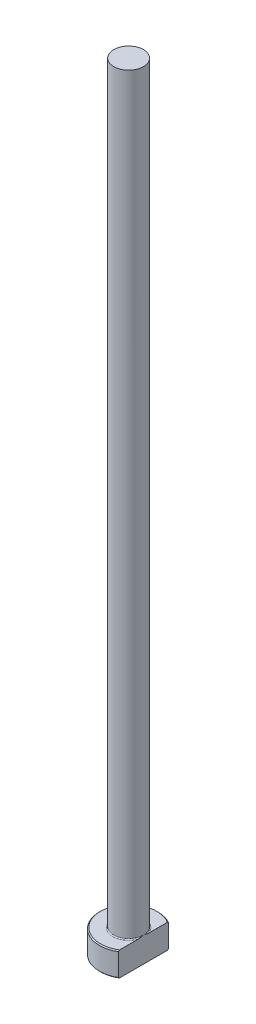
from build123d import *
from build123d.topology import SkipClean

# Parameters (mm, degrees)
CHAMFER1_SIZE = 0.2
FILLET1_R     = 0.2
KEY_DEPTH     = 161.224842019


with BuildPart() as part:
    # Sketch1 → Revolve1 (revolve)
    with BuildSketch(Plane.XY, mode=Mode.PRIVATE) as revolve1_sk:
        Polygon((0, 0), (-6, 0), (-6, 5), (-3.05, 5), (-3.05, 160), (0, 160), align=None)
    revolve(revolve1_sk.sketch.rotate(Axis((0, 259.958771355, 0), (0, -1, 0)), 270), axis=Axis((0, 259.958771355, 0), (0, -1, 0)))

    # Chamfer1
    chamfer1_edges = [part.edges().sort_by_distance(p)[0] for p in [
        (0, 5, -6),
        (0, 0, -6),
    ]]
    chamfer(chamfer1_edges, length=CHAMFER1_SIZE)

    # Fillet1
    fillet1_edges = [part.edges().sort_by_distance(p)[0] for p in [
        (0, 5, -3.05),
    ]]
    fillet(fillet1_edges, radius=FILLET1_R)

    # Sketch2 → KEY (cut, through all)
    with SkipClean():  # the faces are left unmerged after this step: merging them gives an invalid solid
        with BuildSketch(Plane(origin=(0, 0, 0), x_dir=(1, 0, 0), z_dir=(0, 1, 0))):
            with BuildLine():
                Line((3.05, 5.166962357), (3.05, -5.166962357))
                ThreePointArc((3.05, -5.166962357), (6, 0), (3.05, 5.166962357))
            make_face()
        extrude(amount=KEY_DEPTH, mode=Mode.SUBTRACT)


solid = part.part
